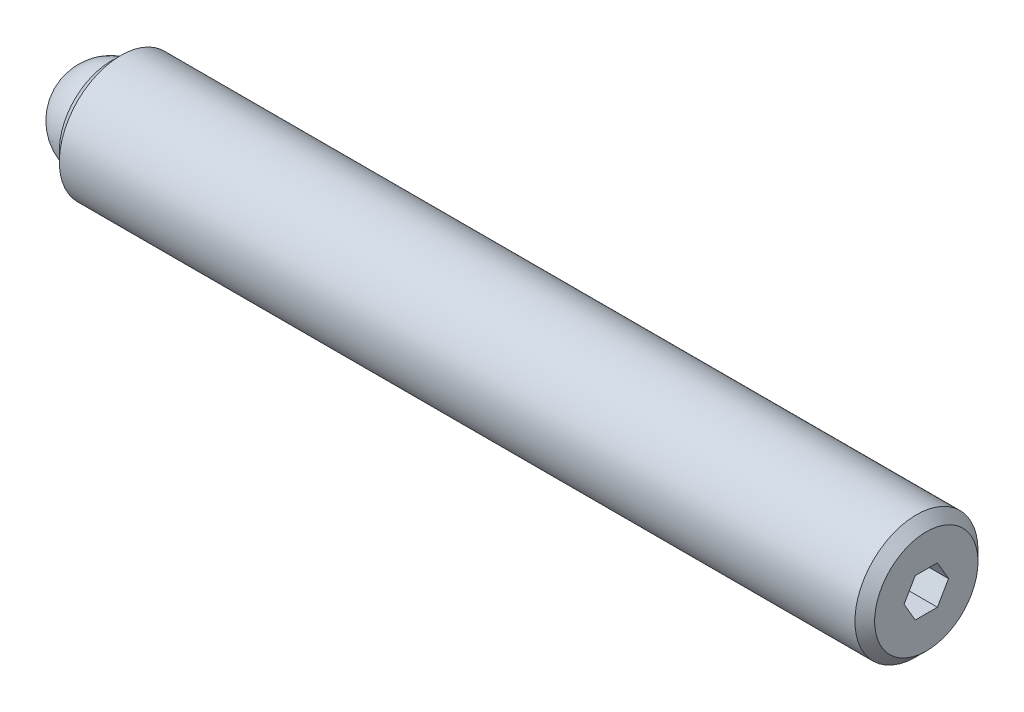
from build123d import *

# Parameters (mm, degrees)
SKETCH2_R           = 3.175
BOSS_EXTRUDE1_DEPTH = 42.06875
CHAMFER1_SIZE       = 0.508
CHAMFER2_SIZE       = 0.508
CUT_EXTRUDE2_DEPTH  = 2.286
SKETCH3_R           = 2.38125
CUT_EXTRUDE3_DEPTH  = 2.38125
CUT_EXTRUDE4_DEPTH  = 2.38125


with BuildPart() as part:
    # Sketch2 → Boss-Extrude1 (new body)
    with BuildSketch(Plane(origin=(0, 0, 0), x_dir=(0, 0, -1), z_dir=(1, 0, 0))):
        Circle(SKETCH2_R)
    extrude(amount=BOSS_EXTRUDE1_DEPTH)

    # Chamfer1
    chamfer1_edges = [part.edges().sort_by_distance(p)[0] for p in [
        (0, 0, 3.175),
    ]]
    chamfer(chamfer1_edges, length=CHAMFER1_SIZE)

    # Chamfer2
    chamfer2_edges = [part.edges().sort_by_distance(p)[0] for p in [
        (42.06875, 0, 3.175),
    ]]
    chamfer(chamfer2_edges, length=CHAMFER2_SIZE)

    # Sketch4 → Cut-Extrude2 (cut)
    with BuildSketch(Plane(origin=(42.06875, 0, 0), x_dir=(0, 0, -1), z_dir=(1, 0, 0))):
        Polygon((1.14567944, 0), (0.57283972, 0.9921875), (-0.57283972, 0.9921875), (-1.14567944, 0), (-0.57283972, -0.9921875), (0.57283972, -0.9921875), align=None)
    extrude(amount=-CUT_EXTRUDE2_DEPTH, mode=Mode.SUBTRACT)

    # Sketch3 → Cut-Extrude3 (cut)
    with BuildSketch(Plane.ZY):
        Circle(SKETCH3_R)
    extrude(amount=-CUT_EXTRUDE3_DEPTH, mode=Mode.SUBTRACT)

    # Sketch7 → Cut-Extrude4 (cut)
    with BuildSketch(Plane.ZY):
        with BuildLine():
            ThreePointArc((0.063494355, 2.380403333), (0, 2.38125), (-0.063494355, 2.380403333))
            ThreePointArc((-0.063494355, 2.380403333), (0, 2.44475), (0.063494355, 2.380403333))
        make_face()
    extrude(amount=-CUT_EXTRUDE4_DEPTH, mode=Mode.SUBTRACT)


with BuildPart() as body_2:
    # Sketch5 → Revolve1 (revolve)
    with BuildSketch(Plane.ZY):
        with BuildLine():
            Line((0, 0), (0, -2.38125))
            ThreePointArc((0, -2.38125), (-2.38125, 0), (0, 2.38125))
            Line((0, 2.38125), (0, 0))
        make_face()
    revolve(axis=Axis((0, 0, 0), (0, 1, 0)))


solid = Compound([part.part, body_2.part])
